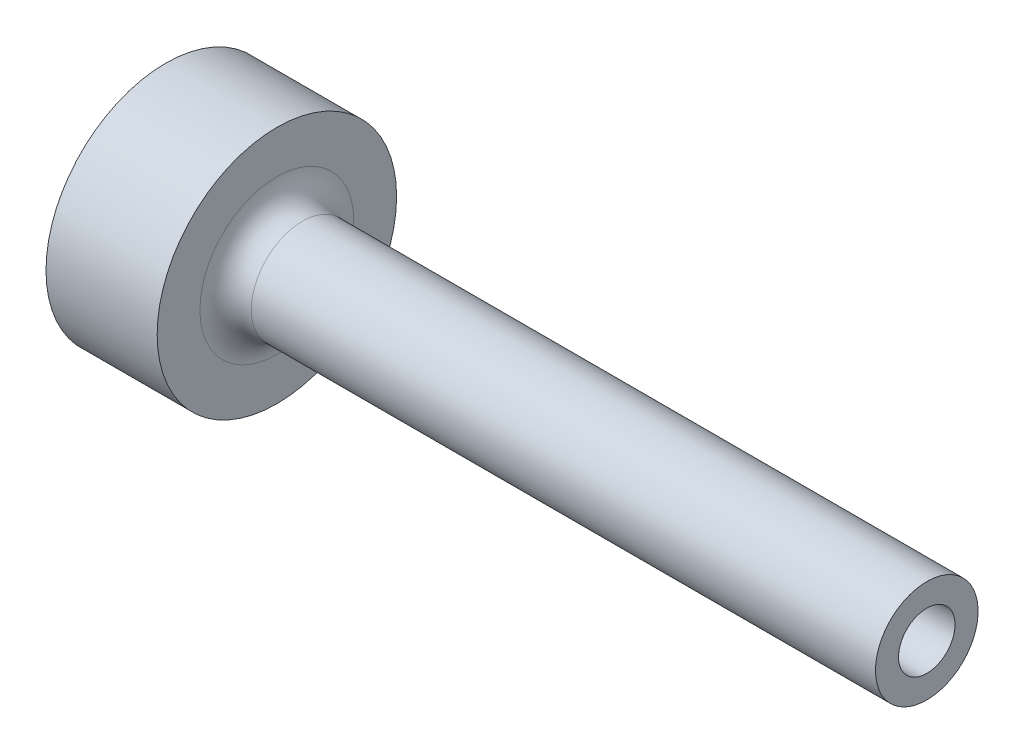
ISO-10303-21;
HEADER;
FILE_DESCRIPTION(('STEP AP214'),'2;1');
FILE_NAME('part.step','',(''),(''),'','','');
FILE_SCHEMA(('AUTOMOTIVE_DESIGN { 1 0 10303 214 1 1 1 1 }'));
ENDSEC;
DATA;
#1=APPLICATION_CONTEXT('core data for automotive mechanical design processes');
#2=APPLICATION_PROTOCOL_DEFINITION('international standard','automotive_design',2000,#1);
#3=PRODUCT_CONTEXT('',#1,'mechanical');
#4=PRODUCT('Part','Part','',(#3));
#5=PRODUCT_RELATED_PRODUCT_CATEGORY('part','',(#4));
#6=PRODUCT_DEFINITION_FORMATION('','',#4);
#7=PRODUCT_DEFINITION_CONTEXT('part definition',#1,'design');
#8=PRODUCT_DEFINITION('design','',#6,#7);
#9=PRODUCT_DEFINITION_SHAPE('','',#8);
#10=(LENGTH_UNIT() NAMED_UNIT(*) SI_UNIT(.MILLI.,.METRE.));
#11=(NAMED_UNIT(*) PLANE_ANGLE_UNIT() SI_UNIT($,.RADIAN.));
#12=(NAMED_UNIT(*) SI_UNIT($,.STERADIAN.) SOLID_ANGLE_UNIT());
#13=UNCERTAINTY_MEASURE_WITH_UNIT(LENGTH_MEASURE(1.E-05),#10,'distance_accuracy_value','');
#14=(GEOMETRIC_REPRESENTATION_CONTEXT(3) GLOBAL_UNCERTAINTY_ASSIGNED_CONTEXT((#13)) GLOBAL_UNIT_ASSIGNED_CONTEXT((#10,
#11,#12)) REPRESENTATION_CONTEXT('',''));
#15=CARTESIAN_POINT('',(0.,0.,0.));
#16=DIRECTION('',(0.,0.,1.));
#17=DIRECTION('',(1.,0.,0.));
#18=AXIS2_PLACEMENT_3D('',#15,#16,#17);
#19=CARTESIAN_POINT('',(0.,0.,0.));
#20=DIRECTION('',(-1.,0.,0.));
#21=DIRECTION('',(0.,0.,1.));
#22=AXIS2_PLACEMENT_3D('',#19,#20,#21);
#23=CYLINDRICAL_SURFACE('',#22,14.);
#24=CARTESIAN_POINT('',(13.,0.,0.));
#25=DIRECTION('',(-1.,0.,0.));
#26=DIRECTION('',(0.,0.,1.));
#27=AXIS2_PLACEMENT_3D('',#24,#25,#26);
#28=CIRCLE('',#27,14.);
#29=CARTESIAN_POINT('',(13.,0.,14.));
#30=VERTEX_POINT('',#29);
#31=EDGE_CURVE('E89',#30,#30,#28,.T.);
#32=ORIENTED_EDGE('',*,*,#31,.T.);
#33=EDGE_LOOP('',(#32));
#34=FACE_BOUND('',#33,.T.);
#35=CARTESIAN_POINT('',(0.,0.,0.));
#36=DIRECTION('',(-1.,0.,0.));
#37=DIRECTION('',(0.,0.,1.));
#38=AXIS2_PLACEMENT_3D('',#35,#36,#37);
#39=CIRCLE('',#38,14.);
#40=CARTESIAN_POINT('',(0.,0.,14.));
#41=VERTEX_POINT('',#40);
#42=EDGE_CURVE('E84',#41,#41,#39,.T.);
#43=ORIENTED_EDGE('',*,*,#42,.F.);
#44=EDGE_LOOP('',(#43));
#45=FACE_BOUND('',#44,.T.);
#46=CARTESIAN_POINT('',(6.5,-13.856406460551,-2.));
#47=CARTESIAN_POINT('',(6.61172417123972,-13.8564082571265,-1.99999534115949));
#48=CARTESIAN_POINT('',(6.72351471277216,-13.8577723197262,-1.99060664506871));
#49=CARTESIAN_POINT('',(6.9439746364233,-13.8630779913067,-1.95330740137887));
#50=CARTESIAN_POINT('',(7.05264079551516,-13.8670221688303,-1.92537839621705));
#51=CARTESIAN_POINT('',(7.26362870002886,-13.8770324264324,-1.85184738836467));
#52=CARTESIAN_POINT('',(7.36595507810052,-13.8830969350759,-1.80625847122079));
#53=CARTESIAN_POINT('',(7.56148972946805,-13.8966626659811,-1.69873175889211));
#54=CARTESIAN_POINT('',(7.65469934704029,-13.9041636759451,-1.63679637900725));
#55=CARTESIAN_POINT('',(7.83004829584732,-13.9198182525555,-1.49785346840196));
#56=CARTESIAN_POINT('',(7.91211171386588,-13.9279757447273,-1.42075056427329));
#57=CARTESIAN_POINT('',(8.06218155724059,-13.9439890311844,-1.25386707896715));
#58=CARTESIAN_POINT('',(8.13018723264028,-13.9518448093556,-1.16408582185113));
#59=CARTESIAN_POINT('',(8.25048909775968,-13.9664103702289,-0.973910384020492));
#60=CARTESIAN_POINT('',(8.30271571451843,-13.9731150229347,-0.873471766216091));
#61=CARTESIAN_POINT('',(8.38953073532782,-13.9845795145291,-0.665136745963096));
#62=CARTESIAN_POINT('',(8.4241199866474,-13.9893394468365,-0.557240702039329));
#63=CARTESIAN_POINT('',(8.47444920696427,-13.9963505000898,-0.337834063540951));
#64=CARTESIAN_POINT('',(8.49031606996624,-13.9986185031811,-0.226353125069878));
#65=CARTESIAN_POINT('',(8.5031438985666,-14.0004479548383,-0.00228956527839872));
#66=CARTESIAN_POINT('',(8.50010582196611,-14.0000095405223,0.110292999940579));
#67=CARTESIAN_POINT('',(8.47531062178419,-13.9964890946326,0.33249899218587));
#68=CARTESIAN_POINT('',(8.45369000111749,-13.9934263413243,0.442137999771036));
#69=CARTESIAN_POINT('',(8.39255744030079,-13.9850228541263,0.656215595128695));
#70=CARTESIAN_POINT('',(8.3530450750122,-13.9796820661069,0.760654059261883));
#71=CARTESIAN_POINT('',(8.25710925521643,-13.9672894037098,0.961781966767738));
#72=CARTESIAN_POINT('',(8.20062784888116,-13.9602316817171,1.05844339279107));
#73=CARTESIAN_POINT('',(8.07239950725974,-13.9451926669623,1.24096782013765));
#74=CARTESIAN_POINT('',(8.00065165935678,-13.9372113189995,1.32683017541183));
#75=CARTESIAN_POINT('',(7.843165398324,-13.921132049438,1.48612299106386));
#76=CARTESIAN_POINT('',(7.75730786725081,-13.9130337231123,1.55943569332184));
#77=CARTESIAN_POINT('',(7.57444547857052,-13.8977029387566,1.69062989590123));
#78=CARTESIAN_POINT('',(7.47744056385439,-13.890470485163,1.74851131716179));
#79=CARTESIAN_POINT('',(7.27491971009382,-13.8776905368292,1.84721301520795));
#80=CARTESIAN_POINT('',(7.1693981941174,-13.8721441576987,1.88802200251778));
#81=CARTESIAN_POINT('',(6.95290242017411,-13.8633846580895,1.9513062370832));
#82=CARTESIAN_POINT('',(6.84192850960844,-13.8601713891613,1.97378265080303));
#83=CARTESIAN_POINT('',(6.61872346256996,-13.8564698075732,1.99960390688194));
#84=CARTESIAN_POINT('',(6.50651197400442,-13.8559577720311,2.00311531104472));
#85=CARTESIAN_POINT('',(6.28310219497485,-13.8576537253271,1.9913480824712));
#86=CARTESIAN_POINT('',(6.17190387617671,-13.8598616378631,1.9760699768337));
#87=CARTESIAN_POINT('',(5.95418781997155,-13.8667269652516,1.92729837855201));
#88=CARTESIAN_POINT('',(5.84765127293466,-13.8713733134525,1.8938871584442));
#89=CARTESIAN_POINT('',(5.6416912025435,-13.8825829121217,1.80988306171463));
#90=CARTESIAN_POINT('',(5.54226800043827,-13.8891462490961,1.75928940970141));
#91=CARTESIAN_POINT('',(5.35260812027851,-13.9035064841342,1.64195360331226));
#92=CARTESIAN_POINT('',(5.26243903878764,-13.911311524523,1.57510320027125));
#93=CARTESIAN_POINT('',(5.09454027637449,-13.9272509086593,1.42730277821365));
#94=CARTESIAN_POINT('',(5.01681123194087,-13.9353852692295,1.34635203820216));
#95=CARTESIAN_POINT('',(4.8754047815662,-13.9511405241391,1.17191708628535));
#96=CARTESIAN_POINT('',(4.81183747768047,-13.9587570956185,1.07834317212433));
#97=CARTESIAN_POINT('',(4.70132443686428,-13.972552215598,0.881748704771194));
#98=CARTESIAN_POINT('',(4.65437828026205,-13.9787308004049,0.778728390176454));
#99=CARTESIAN_POINT('',(4.57861788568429,-13.9889347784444,0.566515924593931));
#100=CARTESIAN_POINT('',(4.54974241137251,-13.9929674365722,0.457345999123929));
#101=CARTESIAN_POINT('',(4.51074453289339,-13.9984555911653,0.235645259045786));
#102=CARTESIAN_POINT('',(4.50062101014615,-13.9999112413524,0.123114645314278));
#103=CARTESIAN_POINT('',(4.49943976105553,-14.0000800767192,-0.101043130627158));
#104=CARTESIAN_POINT('',(4.50821318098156,-13.998817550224,-0.212669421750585));
#105=CARTESIAN_POINT('',(4.54421615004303,-13.9937406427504,-0.432842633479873));
#106=CARTESIAN_POINT('',(4.57144565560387,-13.989926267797,-0.541389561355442));
#107=CARTESIAN_POINT('',(4.6435299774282,-13.9801722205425,-0.752283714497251));
#108=CARTESIAN_POINT('',(4.68837418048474,-13.9742338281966,-0.854634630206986));
#109=CARTESIAN_POINT('',(4.79439714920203,-13.960885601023,-1.05038570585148));
#110=CARTESIAN_POINT('',(4.8555763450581,-13.9534757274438,-1.14378562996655));
#111=CARTESIAN_POINT('',(4.99314771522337,-13.9379304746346,-1.31984194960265));
#112=CARTESIAN_POINT('',(5.06966490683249,-13.9297894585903,-1.40240016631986));
#113=CARTESIAN_POINT('',(5.2354775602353,-13.9137422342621,-1.55356716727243));
#114=CARTESIAN_POINT('',(5.32477602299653,-13.9058360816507,-1.6221726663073));
#115=CARTESIAN_POINT('',(5.51414543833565,-13.8911108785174,-1.74379523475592));
#116=CARTESIAN_POINT('',(5.61426869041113,-13.8842975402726,-1.79673154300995));
#117=CARTESIAN_POINT('',(5.82203229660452,-13.8725962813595,-1.88495902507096));
#118=CARTESIAN_POINT('',(5.92966459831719,-13.8677063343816,-1.92026877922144));
#119=CARTESIAN_POINT('',(6.11483642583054,-13.8615529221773,-1.96409255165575));
#120=CARTESIAN_POINT('',(6.19122433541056,-13.859633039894,-1.97753762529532));
#121=CARTESIAN_POINT('',(6.34506419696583,-13.857059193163,-1.99549291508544));
#122=CARTESIAN_POINT('',(6.42251613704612,-13.8564052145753,-2.00000323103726));
#123=CARTESIAN_POINT('',(6.5,-13.856406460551,-2.));
#124=B_SPLINE_CURVE_WITH_KNOTS('',3,(#46,#47,#48,#49,#50,#51,#52,#53,#54,#55,#56,#57,#58,#59,
#60,#61,#62,#63,#64,#65,#66,#67,#68,#69,#70,#71,#72,#73,#74,#75,#76,#77,#78,#79,#80,#81,#82,#83,
#84,#85,#86,#87,#88,#89,#90,#91,#92,#93,#94,#95,#96,#97,#98,#99,#100,#101,#102,#103,#104,#105,
#106,#107,#108,#109,#110,#111,#112,#113,#114,#115,#116,#117,#118,#119,#120,#121,#122,#123),
.UNSPECIFIED.,.T.,.F.,(4,2,2,2,2,2,2,2,2,2,2,2,2,2,2,2,2,2,2,2,2,2,2,2,2,2,2,2,2,2,2,2,2,2,2,2,
2,2,4),(0.,0.334889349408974,0.670112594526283,1.00508792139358,1.34001378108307,
1.6771171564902,2.01423851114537,2.35282530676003,2.6913958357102,3.02765822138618,
3.36390357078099,3.69769984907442,4.03150405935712,4.36646147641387,4.70143892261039,
5.03940517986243,5.37737316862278,5.7155642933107,6.05373389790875,6.3889286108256,
6.72411392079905,7.05779100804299,7.39148315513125,7.72746121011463,8.06345644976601,
8.40197921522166,8.74049343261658,9.07785422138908,9.41519488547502,9.74953375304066,
10.083871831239,10.4180087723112,10.7521545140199,11.0891434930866,11.426211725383,
11.7649881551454,12.103406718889,12.3356645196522,12.5679197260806),.UNSPECIFIED.);
#125=CARTESIAN_POINT('',(6.5,-13.856406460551,-2.));
#126=VERTEX_POINT('',#125);
#127=EDGE_CURVE('E10',#126,#126,#124,.T.);
#128=ORIENTED_EDGE('',*,*,#127,.F.);
#129=EDGE_LOOP('',(#128));
#130=FACE_BOUND('',#129,.T.);
#131=ADVANCED_FACE('F16',(#34,#45,#130),#23,.T.);
#132=CARTESIAN_POINT('',(0.,0.,0.));
#133=DIRECTION('',(1.,0.,0.));
#134=DIRECTION('',(0.,0.,-1.));
#135=AXIS2_PLACEMENT_3D('',#132,#133,#134);
#136=CONICAL_SURFACE('',#135,1.75,0.0174532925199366);
#137=CARTESIAN_POINT('',(89.,0.,0.));
#138=DIRECTION('',(-1.,0.,0.));
#139=DIRECTION('',(0.,0.,1.));
#140=AXIS2_PLACEMENT_3D('',#137,#138,#139);
#141=CIRCLE('',#140,3.30350077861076);
#142=CARTESIAN_POINT('',(89.,0.,3.30350077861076));
#143=VERTEX_POINT('',#142);
#144=EDGE_CURVE('E81',#143,#143,#141,.T.);
#145=ORIENTED_EDGE('',*,*,#144,.F.);
#146=EDGE_LOOP('',(#145));
#147=FACE_BOUND('',#146,.T.);
#148=CARTESIAN_POINT('',(0.8568945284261,0.,0.));
#149=DIRECTION('',(-1.,0.,0.));
#150=DIRECTION('',(0.,0.,1.));
#151=AXIS2_PLACEMENT_3D('',#148,#149,#150);
#152=CIRCLE('',#151,1.76495714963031);
#153=CARTESIAN_POINT('',(0.8568945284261,0.,1.76495714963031));
#154=VERTEX_POINT('',#153);
#155=EDGE_CURVE('E94',#154,#154,#152,.F.);
#156=ORIENTED_EDGE('',*,*,#155,.F.);
#157=EDGE_LOOP('',(#156));
#158=FACE_BOUND('',#157,.T.);
#159=ADVANCED_FACE('F45',(#147,#158),#136,.F.);
#160=CARTESIAN_POINT('',(16.,0.,0.));
#161=DIRECTION('',(-1.,0.,0.));
#162=DIRECTION('',(0.,0.,1.));
#163=AXIS2_PLACEMENT_3D('',#160,#161,#162);
#164=TOROIDAL_SURFACE('',#163,9.,3.);
#165=CARTESIAN_POINT('',(13.,0.,0.));
#166=DIRECTION('',(-1.,0.,0.));
#167=DIRECTION('',(0.,0.,1.));
#168=AXIS2_PLACEMENT_3D('',#165,#166,#167);
#169=CIRCLE('',#168,9.);
#170=CARTESIAN_POINT('',(13.,0.,9.));
#171=VERTEX_POINT('',#170);
#172=EDGE_CURVE('E91',#171,#171,#169,.T.);
#173=ORIENTED_EDGE('',*,*,#172,.F.);
#174=EDGE_LOOP('',(#173));
#175=FACE_BOUND('',#174,.T.);
#176=CARTESIAN_POINT('',(16.,0.,0.));
#177=DIRECTION('',(-1.,0.,0.));
#178=DIRECTION('',(0.,0.,1.));
#179=AXIS2_PLACEMENT_3D('',#176,#177,#178);
#180=CIRCLE('',#179,6.);
#181=CARTESIAN_POINT('',(16.,0.,6.));
#182=VERTEX_POINT('',#181);
#183=EDGE_CURVE('E28',#182,#182,#180,.T.);
#184=ORIENTED_EDGE('',*,*,#183,.T.);
#185=EDGE_LOOP('',(#184));
#186=FACE_BOUND('',#185,.T.);
#187=ADVANCED_FACE('F18',(#175,#186),#164,.F.);
#188=CARTESIAN_POINT('',(0.,0.,0.));
#189=DIRECTION('',(-1.,0.,0.));
#190=DIRECTION('',(0.,0.,1.));
#191=AXIS2_PLACEMENT_3D('',#188,#189,#190);
#192=CYLINDRICAL_SURFACE('',#191,6.);
#193=ORIENTED_EDGE('',*,*,#183,.F.);
#194=EDGE_LOOP('',(#193));
#195=FACE_BOUND('',#194,.T.);
#196=CARTESIAN_POINT('',(89.,0.,0.));
#197=DIRECTION('',(-1.,0.,0.));
#198=DIRECTION('',(0.,0.,1.));
#199=AXIS2_PLACEMENT_3D('',#196,#197,#198);
#200=CIRCLE('',#199,6.);
#201=CARTESIAN_POINT('',(89.,0.,6.));
#202=VERTEX_POINT('',#201);
#203=EDGE_CURVE('E80',#202,#202,#200,.T.);
#204=ORIENTED_EDGE('',*,*,#203,.T.);
#205=EDGE_LOOP('',(#204));
#206=FACE_BOUND('',#205,.T.);
#207=ADVANCED_FACE('F66',(#195,#206),#192,.T.);
#208=CARTESIAN_POINT('',(89.,6.,0.));
#209=DIRECTION('',(-1.,0.,0.));
#210=DIRECTION('',(0.,0.,1.));
#211=AXIS2_PLACEMENT_3D('',#208,#209,#210);
#212=PLANE('',#211);
#213=ORIENTED_EDGE('',*,*,#203,.F.);
#214=EDGE_LOOP('',(#213));
#215=FACE_BOUND('',#214,.T.);
#216=ORIENTED_EDGE('',*,*,#144,.T.);
#217=EDGE_LOOP('',(#216));
#218=FACE_BOUND('',#217,.T.);
#219=ADVANCED_FACE('F62',(#215,#218),#212,.F.);
#220=CARTESIAN_POINT('',(0.,1.75,0.));
#221=DIRECTION('',(1.,0.,0.));
#222=DIRECTION('',(0.,0.,-1.));
#223=AXIS2_PLACEMENT_3D('',#220,#221,#222);
#224=PLANE('',#223);
#225=CARTESIAN_POINT('',(0.,0.,0.));
#226=DIRECTION('',(-1.,0.,0.));
#227=DIRECTION('',(0.,0.,1.));
#228=AXIS2_PLACEMENT_3D('',#225,#226,#227);
#229=CIRCLE('',#228,5.);
#230=CARTESIAN_POINT('',(0.,0.,5.));
#231=VERTEX_POINT('',#230);
#232=EDGE_CURVE('E97',#231,#231,#229,.T.);
#233=ORIENTED_EDGE('',*,*,#232,.F.);
#234=EDGE_LOOP('',(#233));
#235=FACE_BOUND('',#234,.T.);
#236=ORIENTED_EDGE('',*,*,#42,.T.);
#237=EDGE_LOOP('',(#236));
#238=FACE_BOUND('',#237,.T.);
#239=ADVANCED_FACE('F60',(#235,#238),#224,.F.);
#240=CARTESIAN_POINT('',(13.,14.,0.));
#241=DIRECTION('',(-1.,0.,0.));
#242=DIRECTION('',(0.,0.,1.));
#243=AXIS2_PLACEMENT_3D('',#240,#241,#242);
#244=PLANE('',#243);
#245=ORIENTED_EDGE('',*,*,#31,.F.);
#246=EDGE_LOOP('',(#245));
#247=FACE_BOUND('',#246,.T.);
#248=ORIENTED_EDGE('',*,*,#172,.T.);
#249=EDGE_LOOP('',(#248));
#250=FACE_BOUND('',#249,.T.);
#251=ADVANCED_FACE('F58',(#247,#250),#244,.F.);
#252=CARTESIAN_POINT('',(-14.4672767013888,0.,0.));
#253=DIRECTION('',(-1.,0.,0.));
#254=DIRECTION('',(0.,0.,1.));
#255=AXIS2_PLACEMENT_3D('',#252,#253,#254);
#256=DEGENERATE_TOROIDAL_SURFACE('',#255,0.56308411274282,15.5,.F.);
#257=ORIENTED_EDGE('',*,*,#232,.T.);
#258=EDGE_LOOP('',(#257));
#259=FACE_BOUND('',#258,.T.);
#260=ORIENTED_EDGE('',*,*,#155,.T.);
#261=EDGE_LOOP('',(#260));
#262=FACE_BOUND('',#261,.T.);
#263=ADVANCED_FACE('F41',(#259,#262),#256,.T.);
#264=CARTESIAN_POINT('',(6.5,-14.,0.));
#265=DIRECTION('',(0.,-1.,0.));
#266=DIRECTION('',(0.,0.,-1.));
#267=AXIS2_PLACEMENT_3D('',#264,#265,#266);
#268=CYLINDRICAL_SURFACE('',#267,2.);
#269=CARTESIAN_POINT('',(6.5,-8.,0.));
#270=DIRECTION('',(0.,-1.,0.));
#271=DIRECTION('',(0.,0.,-1.));
#272=AXIS2_PLACEMENT_3D('',#269,#270,#271);
#273=CIRCLE('',#272,2.);
#274=CARTESIAN_POINT('',(6.5,-8.,-2.));
#275=VERTEX_POINT('',#274);
#276=EDGE_CURVE('E100',#275,#275,#273,.T.);
#277=ORIENTED_EDGE('',*,*,#276,.F.);
#278=EDGE_LOOP('',(#277));
#279=FACE_BOUND('',#278,.T.);
#280=ORIENTED_EDGE('',*,*,#127,.T.);
#281=EDGE_LOOP('',(#280));
#282=FACE_BOUND('',#281,.T.);
#283=ADVANCED_FACE('F33',(#279,#282),#268,.F.);
#284=CARTESIAN_POINT('',(6.5,-6.84529946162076,0.));
#285=DIRECTION('',(0.,-1.,0.));
#286=DIRECTION('',(0.,0.,-1.));
#287=AXIS2_PLACEMENT_3D('',#284,#285,#286);
#288=CONICAL_SURFACE('',#287,0.,1.0471975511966);
#289=ORIENTED_EDGE('',*,*,#276,.T.);
#290=EDGE_LOOP('',(#289));
#291=FACE_BOUND('',#290,.T.);
#292=CARTESIAN_POINT('',(6.5,-6.84529946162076,0.));
#293=VERTEX_POINT('',#292);
#294=VERTEX_LOOP('',#293);
#295=FACE_BOUND('',#294,.T.);
#296=ADVANCED_FACE('F31',(#291,#295),#288,.F.);
#297=CLOSED_SHELL('',(#131,#159,#187,#207,#219,#239,#251,#263,#283,#296));
#298=MANIFOLD_SOLID_BREP('B1',#297);
#299=ADVANCED_BREP_SHAPE_REPRESENTATION('',(#18,#298),#14);
#300=SHAPE_DEFINITION_REPRESENTATION(#9,#299);
ENDSEC;
END-ISO-10303-21;
